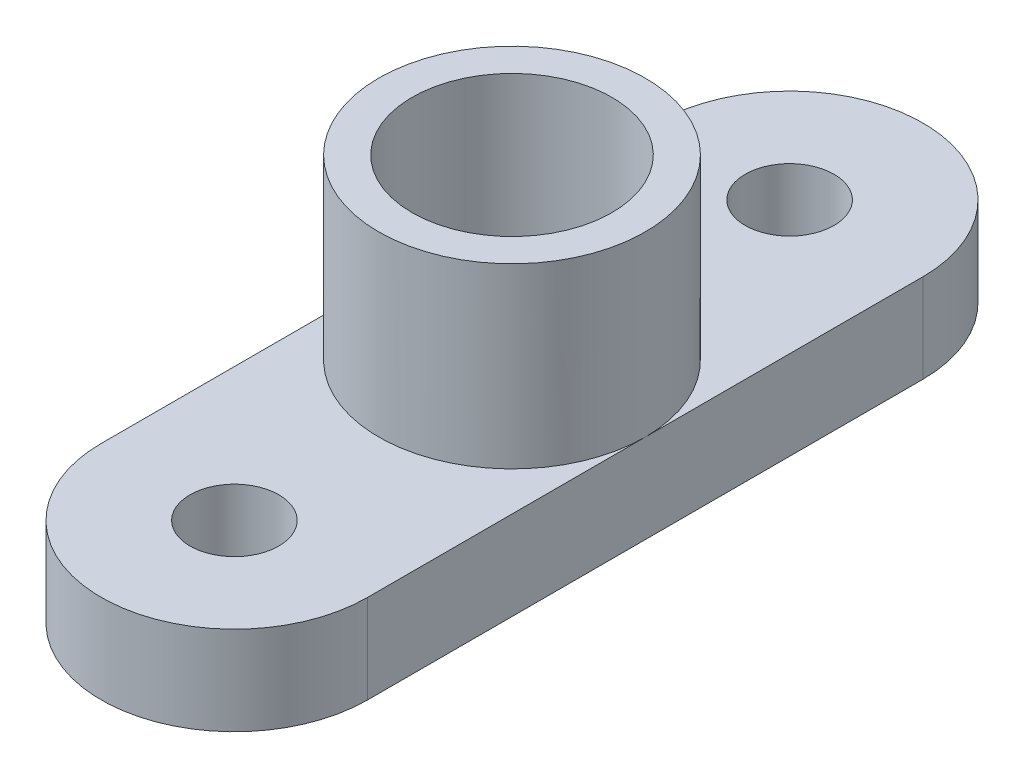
from build123d import *

# Parameters (mm, degrees)
SKETCH_1_R          = 12
EXTRUDE_1_DEPTH     = 16
SKETCH_2_R          = 4
EXTRUDE_2_DEPTH     = 8
CUT_EXTRUDE_START   = -24
SKETCH_3_R          = 9
CUT_EXTRUDE_1_DEPTH = 24


with BuildPart() as part:
    # Sketch 1 → Extrude 1 (new body)
    with BuildSketch(Plane(origin=(0, 0, 0), x_dir=(1, 0, 0), z_dir=(0, 1, 0))):
        with Locations(Location((0, 0, 0), (0, 0, 270))):
            Circle(SKETCH_1_R)
    extrude(amount=EXTRUDE_1_DEPTH)

    # Sketch 2 → Extrude 2 (add)
    with BuildSketch(Plane.XZ):
        with BuildLine():
            Line((12, 25), (12, -25))
            ThreePointArc((12, -25), (0, -37), (-12, -25))
            Line((-12, -25), (-12, 25))
            ThreePointArc((-12, 25), (0, 37), (12, 25))
        make_face()
        with Locations(Location((0, -25, 0), (0, 0, 270))):
            Circle(SKETCH_2_R, mode=Mode.SUBTRACT)
        with Locations(Location((0, 25, 0), (0, 0, 270))):
            Circle(SKETCH_2_R, mode=Mode.SUBTRACT)
    extrude(amount=EXTRUDE_2_DEPTH)

    # Sketch 3 → Cut-Extrude 1 (cut)
    with BuildSketch(Plane(origin=(0, 16, 0), x_dir=(-1, 0, 0), z_dir=(0, 1, 0)).offset(CUT_EXTRUDE_START)):
        with Locations(Location((0, 0, 0), (0, 0, 90))):
            Circle(SKETCH_3_R)
    extrude(amount=CUT_EXTRUDE_1_DEPTH, mode=Mode.SUBTRACT)


solid = part.part
